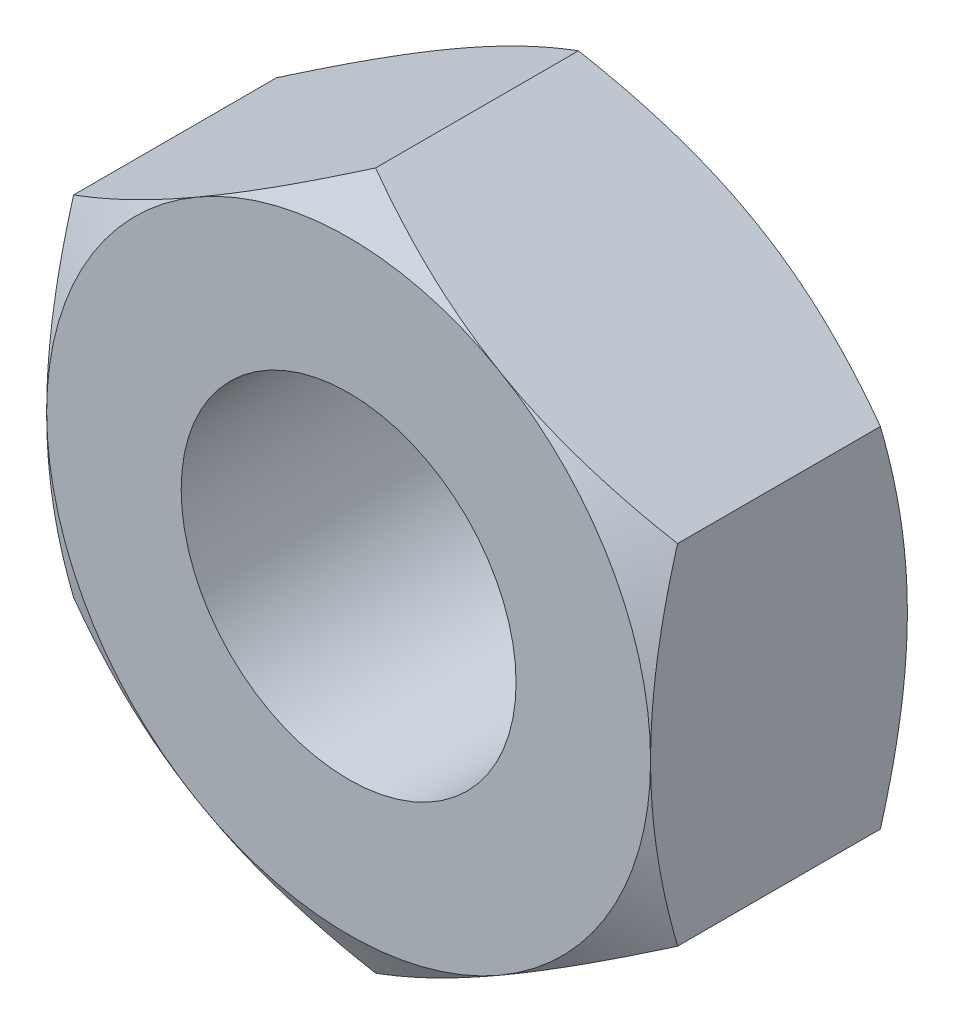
from build123d import *

# Parameters (mm, degrees)
BASE_EXTRUSION_DEPTH    = 2.3
ESQUISSE3_R             = 1.5
ENL_V_MAT_EXTRU_1_DEPTH = 5.72895954


with BuildPart() as part:
    # Esquisse1 → Base-Extrusion (new body)
    with BuildSketch(Plane.XY):
        Polygon((2.705, -1.561732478), (2.705, 1.561732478), (0, 3.123464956), (-2.705, 1.561732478), (-2.705, -1.561732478), (0, -3.123464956), align=None)
    extrude(amount=-BASE_EXTRUSION_DEPTH)

    # Esquisse2 → Enl_vement de mati_re-R_volution1 (revolve, cut)
    with BuildSketch(Plane(origin=(0, 0, 0), x_dir=(1, 0, 0), z_dir=(0, 1, 0))):
        Polygon((-2.705, 0), (-5.696858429, 0), (-5.696858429, 2.3), (-2.705, 2.3), (-4.696858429, 1.15), align=None)
    revolve(axis=Axis((0, 0, -2.3), (0, 0, 1)), mode=Mode.SUBTRACT)

    # Esquisse3 → Enl_v. mat.-Extru.1 (cut, through all)
    with BuildSketch(Plane.XY):
        Circle(ESQUISSE3_R)
    extrude(amount=-ENL_V_MAT_EXTRU_1_DEPTH, mode=Mode.SUBTRACT)


solid = part.part
